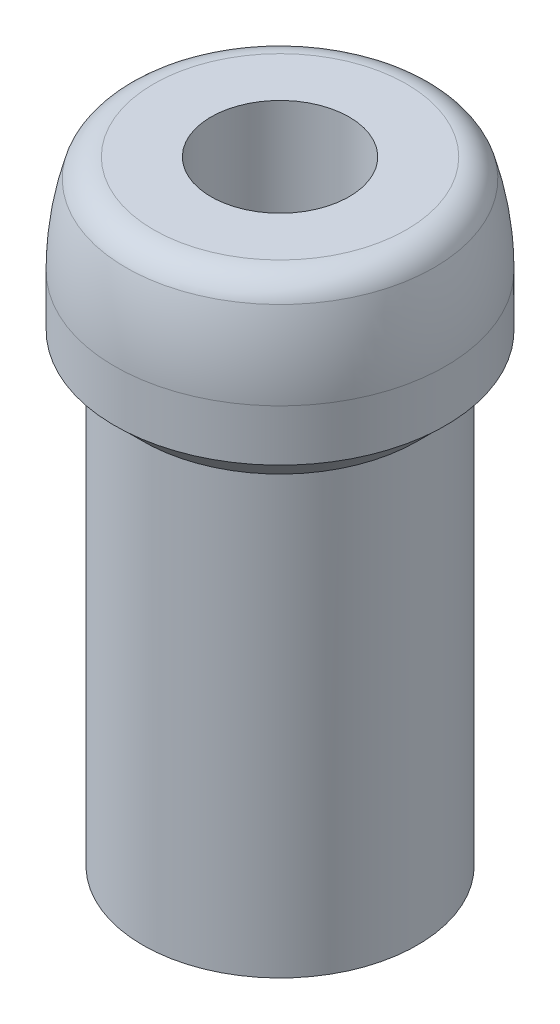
from build123d import *

# Parameters (mm, degrees)
SKICA1_R                 = 6.95
P_IDAT_VYSUNUT_M1_DEPTH  = 23.5
ZKOSEN_1_SIZE            = 1.4
SKICA4_R                 = 3.5
ODEBRAT_VYSUNUT_M1_DEPTH = 34.280347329


with BuildPart() as part:
    # Skica1 → P_idat vysunut_m1 (new body)
    with BuildSketch(Plane(origin=(0, 0, 0), x_dir=(1, 0, 0), z_dir=(0, 1, 0))):
        with Locations(Location((0, 0, 0), (0, 0, 270))):
            Circle(SKICA1_R)
    extrude(amount=P_IDAT_VYSUNUT_M1_DEPTH)

    # Skica3 → Rotovat1 (revolve)
    with BuildSketch(Plane.XY):
        with BuildLine():
            Line((0, 23.5), (-8.377572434, 23.5))
            Line((-8.377572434, 23.5), (-8.377572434, 26.1))
            ThreePointArc((-8.377572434, 26.1), (-8.236678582, 28.140409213), (-7.8, 30.138516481))
            ThreePointArc((-7.8, 30.138516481), (-7.249183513, 30.836481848), (-6.4, 31.1))
            Line((-6.4, 31.1), (0, 31.1))
            Line((0, 31.1), (0, 23.5))
        make_face()
    revolve(axis=Axis((0, 31.1, 0), (0, -1, 0)))

    # Zkosen_1
    zkosen_1_edges = [part.edges().sort_by_distance(p)[0] for p in [
        (0, 23.5, -6.95),
    ]]
    chamfer(zkosen_1_edges, length=ZKOSEN_1_SIZE)

    # Skica4 → Odebrat vysunut_m1 (cut, through all)
    with BuildSketch(Plane.XZ):
        with Locations(Location((0, 0, 0), (0, 0, 270))):
            Circle(SKICA4_R)
    extrude(amount=-ODEBRAT_VYSUNUT_M1_DEPTH, mode=Mode.SUBTRACT)


solid = part.part
